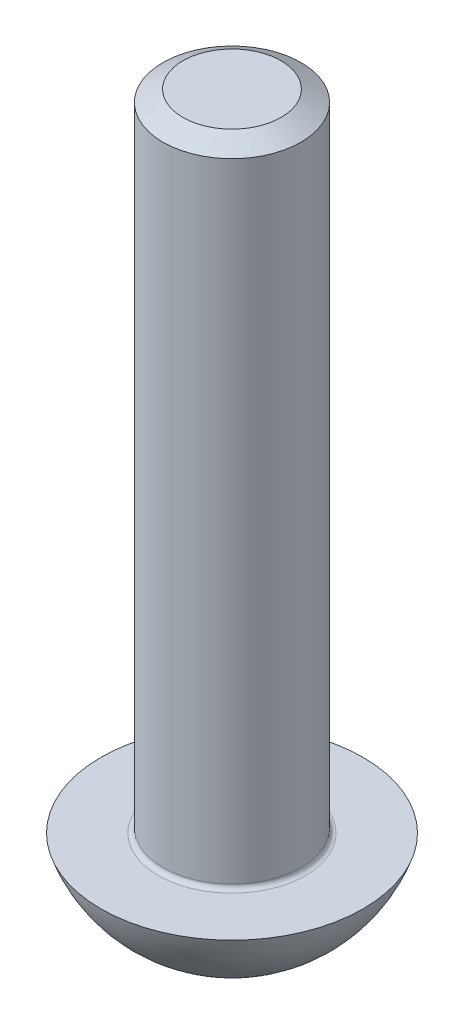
ISO-10303-21;
HEADER;
FILE_DESCRIPTION(('STEP AP214'),'2;1');
FILE_NAME('part.step','',(''),(''),'','','');
FILE_SCHEMA(('AUTOMOTIVE_DESIGN { 1 0 10303 214 1 1 1 1 }'));
ENDSEC;
DATA;
#1=APPLICATION_CONTEXT('core data for automotive mechanical design processes');
#2=APPLICATION_PROTOCOL_DEFINITION('international standard','automotive_design',2000,#1);
#3=PRODUCT_CONTEXT('',#1,'mechanical');
#4=PRODUCT('Part','Part','',(#3));
#5=PRODUCT_RELATED_PRODUCT_CATEGORY('part','',(#4));
#6=PRODUCT_DEFINITION_FORMATION('','',#4);
#7=PRODUCT_DEFINITION_CONTEXT('part definition',#1,'design');
#8=PRODUCT_DEFINITION('design','',#6,#7);
#9=PRODUCT_DEFINITION_SHAPE('','',#8);
#10=(LENGTH_UNIT() NAMED_UNIT(*) SI_UNIT(.MILLI.,.METRE.));
#11=(NAMED_UNIT(*) PLANE_ANGLE_UNIT() SI_UNIT($,.RADIAN.));
#12=(NAMED_UNIT(*) SI_UNIT($,.STERADIAN.) SOLID_ANGLE_UNIT());
#13=UNCERTAINTY_MEASURE_WITH_UNIT(LENGTH_MEASURE(1.E-05),#10,'distance_accuracy_value','');
#14=(GEOMETRIC_REPRESENTATION_CONTEXT(3) GLOBAL_UNCERTAINTY_ASSIGNED_CONTEXT((#13)) GLOBAL_UNIT_ASSIGNED_CONTEXT((#10,
#11,#12)) REPRESENTATION_CONTEXT('',''));
#15=CARTESIAN_POINT('',(0.,0.,0.));
#16=DIRECTION('',(0.,0.,1.));
#17=DIRECTION('',(1.,0.,0.));
#18=AXIS2_PLACEMENT_3D('',#15,#16,#17);
#19=CARTESIAN_POINT('',(1003.04356921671,1012.71699558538,1046.17212852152));
#20=DIRECTION('',(0.,-1.,0.));
#21=DIRECTION('',(0.,0.,1.));
#22=AXIS2_PLACEMENT_3D('',#19,#20,#21);
#23=CYLINDRICAL_SURFACE('',#22,1.50000000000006);
#24=CARTESIAN_POINT('',(1003.04356921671,1014.46699558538,1046.17212852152));
#25=DIRECTION('',(0.,-1.,0.));
#26=DIRECTION('',(0.,0.,1.));
#27=AXIS2_PLACEMENT_3D('',#24,#25,#26);
#28=CIRCLE('',#27,1.50000000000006);
#29=CARTESIAN_POINT('',(1003.04356921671,1014.46699558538,1047.67212852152));
#30=VERTEX_POINT('',#29);
#31=EDGE_CURVE('E162',#30,#30,#28,.T.);
#32=ORIENTED_EDGE('',*,*,#31,.F.);
#33=EDGE_LOOP('',(#32));
#34=FACE_BOUND('',#33,.T.);
#35=CARTESIAN_POINT('',(1003.04356921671,1028.11699558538,1046.17212852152));
#36=DIRECTION('',(0.,-1.,0.));
#37=DIRECTION('',(0.,0.,1.));
#38=AXIS2_PLACEMENT_3D('',#35,#36,#37);
#39=CIRCLE('',#38,1.50000000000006);
#40=CARTESIAN_POINT('',(1003.04356921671,1028.11699558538,1047.67212852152));
#41=VERTEX_POINT('',#40);
#42=EDGE_CURVE('E139',#41,#41,#39,.T.);
#43=ORIENTED_EDGE('',*,*,#42,.T.);
#44=EDGE_LOOP('',(#43));
#45=FACE_BOUND('',#44,.T.);
#46=ADVANCED_FACE('F17',(#34,#45),#23,.T.);
#47=CARTESIAN_POINT('',(1003.04356921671,1012.71699558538,1046.17212852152));
#48=DIRECTION('',(0.,1.,0.));
#49=DIRECTION('',(1.,0.,0.));
#50=AXIS2_PLACEMENT_3D('',#47,#48,#49);
#51=PLANE('',#50);
#52=CARTESIAN_POINT('',(1003.04356921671,1012.71699558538,1046.17212852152));
#53=DIRECTION('',(0.,-1.,0.));
#54=DIRECTION('',(0.,0.,-1.));
#55=AXIS2_PLACEMENT_3D('',#52,#53,#54);
#56=CIRCLE('',#55,1.15470053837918);
#57=CARTESIAN_POINT('',(1003.6209194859,1012.716995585,1045.17212852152));
#58=VERTEX_POINT('',#57);
#59=CARTESIAN_POINT('',(1004.19826975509,1012.716995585,1046.17212852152));
#60=VERTEX_POINT('',#59);
#61=EDGE_CURVE('E186',#58,#60,#56,.T.);
#62=ORIENTED_EDGE('',*,*,#61,.F.);
#63=CARTESIAN_POINT('',(1003.04356921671,1012.71699558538,1046.17212852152));
#64=DIRECTION('',(0.,-1.,0.));
#65=DIRECTION('',(0.,0.,-1.));
#66=AXIS2_PLACEMENT_3D('',#63,#64,#65);
#67=CIRCLE('',#66,1.15470053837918);
#68=CARTESIAN_POINT('',(1002.46621894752,1012.716995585,1045.17212852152));
#69=VERTEX_POINT('',#68);
#70=EDGE_CURVE('E163',#69,#58,#67,.T.);
#71=ORIENTED_EDGE('',*,*,#70,.F.);
#72=CARTESIAN_POINT('',(1003.04356921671,1012.71699558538,1046.17212852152));
#73=DIRECTION('',(0.,-1.,0.));
#74=DIRECTION('',(0.,0.,-1.));
#75=AXIS2_PLACEMENT_3D('',#72,#73,#74);
#76=CIRCLE('',#75,1.15470053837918);
#77=CARTESIAN_POINT('',(1001.88886867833,1012.716995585,1046.17212852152));
#78=VERTEX_POINT('',#77);
#79=EDGE_CURVE('E92',#78,#69,#76,.T.);
#80=ORIENTED_EDGE('',*,*,#79,.F.);
#81=CARTESIAN_POINT('',(1003.04356921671,1012.71699558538,1046.17212852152));
#82=DIRECTION('',(0.,-1.,0.));
#83=DIRECTION('',(0.,0.,1.));
#84=AXIS2_PLACEMENT_3D('',#81,#82,#83);
#85=CIRCLE('',#84,1.15470053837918);
#86=CARTESIAN_POINT('',(1002.46621894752,1012.716995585,1047.17212852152));
#87=VERTEX_POINT('',#86);
#88=EDGE_CURVE('E105',#87,#78,#85,.T.);
#89=ORIENTED_EDGE('',*,*,#88,.F.);
#90=CARTESIAN_POINT('',(1003.04356921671,1012.71699558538,1046.17212852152));
#91=DIRECTION('',(0.,-1.,0.));
#92=DIRECTION('',(0.,0.,-1.));
#93=AXIS2_PLACEMENT_3D('',#90,#91,#92);
#94=CIRCLE('',#93,1.15470053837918);
#95=CARTESIAN_POINT('',(1003.6209194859,1012.71699558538,1047.17212852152));
#96=VERTEX_POINT('',#95);
#97=EDGE_CURVE('E99',#96,#87,#94,.T.);
#98=ORIENTED_EDGE('',*,*,#97,.F.);
#99=CARTESIAN_POINT('',(1003.04356921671,1012.71699558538,1046.17212852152));
#100=DIRECTION('',(0.,-1.,0.));
#101=DIRECTION('',(0.,0.,-1.));
#102=AXIS2_PLACEMENT_3D('',#99,#100,#101);
#103=CIRCLE('',#102,1.15470053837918);
#104=EDGE_CURVE('E106',#60,#96,#103,.T.);
#105=ORIENTED_EDGE('',*,*,#104,.F.);
#106=EDGE_LOOP('',(#62,#71,#80,#89,#98,#105));
#107=FACE_BOUND('',#106,.T.);
#108=CARTESIAN_POINT('',(1003.04356921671,1012.71699558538,1046.17212852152));
#109=DIRECTION('',(0.,-1.,0.));
#110=DIRECTION('',(0.,0.,1.));
#111=AXIS2_PLACEMENT_3D('',#108,#109,#110);
#112=CIRCLE('',#111,1.50000000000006);
#113=CARTESIAN_POINT('',(1001.54356921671,1012.71699558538,1046.17212852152));
#114=VERTEX_POINT('',#113);
#115=EDGE_CURVE('E11',#114,#114,#112,.T.);
#116=ORIENTED_EDGE('',*,*,#115,.T.);
#117=EDGE_LOOP('',(#116));
#118=FACE_BOUND('',#117,.T.);
#119=ADVANCED_FACE('F109',(#107,#118),#51,.F.);
#120=CARTESIAN_POINT('',(1003.04356921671,1015.32154103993,1046.17212852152));
#121=DIRECTION('',(0.,1.,0.));
#122=DIRECTION('',(-1.,0.,0.));
#123=AXIS2_PLACEMENT_3D('',#120,#121,#122);
#124=SPHERICAL_SURFACE('',#123,3.0056042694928);
#125=CARTESIAN_POINT('',(1003.04356921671,1014.36699558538,1046.17212852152));
#126=DIRECTION('',(0.,-1.,0.));
#127=DIRECTION('',(0.,0.,1.));
#128=AXIS2_PLACEMENT_3D('',#125,#126,#127);
#129=CIRCLE('',#128,2.85);
#130=CARTESIAN_POINT('',(1000.19356921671,1014.36699558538,1046.17212852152));
#131=VERTEX_POINT('',#130);
#132=EDGE_CURVE('E33',#131,#131,#129,.T.);
#133=CARTESIAN_POINT('',(1001.54356921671,1012.71699558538,1046.17212852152));
#134=CARTESIAN_POINT('',(1001.52389704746,1012.72832505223,1046.17212852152));
#135=CARTESIAN_POINT('',(1001.50435328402,1012.73987747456,1046.17212852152));
#136=CARTESIAN_POINT('',(1001.46553249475,1012.76342212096,1046.17212852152));
#137=CARTESIAN_POINT('',(1001.44625546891,1012.77541434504,1046.17212852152));
#138=CARTESIAN_POINT('',(1001.40797808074,1012.79983248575,1046.17212852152));
#139=CARTESIAN_POINT('',(1001.38897771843,1012.81225840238,1046.17212852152));
#140=CARTESIAN_POINT('',(1001.35126340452,1012.83753753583,1046.17212852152));
#141=CARTESIAN_POINT('',(1001.33254945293,1012.85039075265,1046.17212852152));
#142=CARTESIAN_POINT('',(1001.29541757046,1012.87651789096,1046.17212852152));
#143=CARTESIAN_POINT('',(1001.27699963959,1012.88979181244,1046.17212852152));
#144=CARTESIAN_POINT('',(1001.24046925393,1012.91675354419,1046.17212852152));
#145=CARTESIAN_POINT('',(1001.22235679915,1012.93044135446,1046.17212852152));
#146=CARTESIAN_POINT('',(1001.18644666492,1012.9582238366,1046.17212852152));
#147=CARTESIAN_POINT('',(1001.16864898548,1012.97231850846,1046.17212852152));
#148=CARTESIAN_POINT('',(1001.13337753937,1013.00090747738,1046.17212852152));
#149=CARTESIAN_POINT('',(1001.11590377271,1013.01540177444,1046.17212852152));
#150=CARTESIAN_POINT('',(1001.08128912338,1013.04478255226,1046.17212852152));
#151=CARTESIAN_POINT('',(1001.06414824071,1013.05966903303,1046.17212852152));
#152=CARTESIAN_POINT('',(1001.03020815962,1013.08982653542,1046.17212852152));
#153=CARTESIAN_POINT('',(1001.01340896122,1013.10509755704,1046.17212852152));
#154=CARTESIAN_POINT('',(1000.98016087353,1013.13601630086,1046.17212852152));
#155=CARTESIAN_POINT('',(1000.96371198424,1013.15166402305,1046.17212852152));
#156=CARTESIAN_POINT('',(1000.93117295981,1013.18332813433,1046.17212852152));
#157=CARTESIAN_POINT('',(1000.91508282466,1013.19934452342,1046.17212852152));
#158=CARTESIAN_POINT('',(1000.88326956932,1013.23173774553,1046.17212852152));
#159=CARTESIAN_POINT('',(1000.86754644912,1013.24811457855,1046.17212852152));
#160=CARTESIAN_POINT('',(1000.83647529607,1013.28122028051,1046.17212852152));
#161=CARTESIAN_POINT('',(1000.82112726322,1013.29794914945,1046.17212852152));
#162=CARTESIAN_POINT('',(1000.79081416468,1013.33175033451,1046.17212852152));
#163=CARTESIAN_POINT('',(1000.77584909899,1013.34882265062,1046.17212852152));
#164=CARTESIAN_POINT('',(1000.74630961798,1013.38330196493,1046.17212852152));
#165=CARTESIAN_POINT('',(1000.73173520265,1013.40070896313,1046.17212852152));
#166=CARTESIAN_POINT('',(1000.70298450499,1013.43584870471,1046.17212852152));
#167=CARTESIAN_POINT('',(1000.68880822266,1013.4535814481,1046.17212852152));
#168=CARTESIAN_POINT('',(1000.66086106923,1013.48936357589,1046.17212852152));
#169=CARTESIAN_POINT('',(1000.64709019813,1013.5074129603,1046.17212852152));
#170=CARTESIAN_POINT('',(1000.61996093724,1013.54381910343,1046.17212852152));
#171=CARTESIAN_POINT('',(1000.60660254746,1013.56217586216,1046.17212852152));
#172=CARTESIAN_POINT('',(1000.58030510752,1013.59918732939,1046.17212852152));
#173=CARTESIAN_POINT('',(1000.56736605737,1013.61784203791,1046.17212852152));
#174=CARTESIAN_POINT('',(1000.54191393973,1013.65543982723,1046.17212852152));
#175=CARTESIAN_POINT('',(1000.52940087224,1013.67438290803,1046.17212852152));
#176=CARTESIAN_POINT('',(1000.50480714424,1013.71254771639,1046.17212852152));
#177=CARTESIAN_POINT('',(1000.49272648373,1013.73176944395,1046.17212852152));
#178=CARTESIAN_POINT('',(1000.469003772,1013.77048167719,1046.17212852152));
#179=CARTESIAN_POINT('',(1000.45736172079,1013.78997218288,1046.17212852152));
#180=CARTESIAN_POINT('',(1000.4345222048,1013.8292119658,1046.17212852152));
#181=CARTESIAN_POINT('',(1000.42332474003,1013.84896124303,1046.17212852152));
#182=CARTESIAN_POINT('',(1000.40138014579,1013.88870842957,1046.17212852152));
#183=CARTESIAN_POINT('',(1000.39063301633,1013.90870633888,1046.17212852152));
#184=CARTESIAN_POINT('',(1000.36959461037,1013.94894052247,1046.17212852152));
#185=CARTESIAN_POINT('',(1000.35930333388,1013.96917679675,1046.17212852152));
#186=CARTESIAN_POINT('',(1000.33918191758,1014.00987732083,1046.17212852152));
#187=CARTESIAN_POINT('',(1000.32935177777,1014.03034157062,1046.17212852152));
#188=CARTESIAN_POINT('',(1000.31015768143,1014.07148753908,1046.17212852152));
#189=CARTESIAN_POINT('',(1000.3007937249,1014.09216925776,1046.17212852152));
#190=CARTESIAN_POINT('',(1000.28253680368,1014.13373954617,1046.17212852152));
#191=CARTESIAN_POINT('',(1000.273643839,1014.15462811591,1046.17212852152));
#192=CARTESIAN_POINT('',(1000.25633346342,1014.19660138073,1046.17212852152));
#193=CARTESIAN_POINT('',(1000.24791605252,1014.2176860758,1046.17212852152));
#194=CARTESIAN_POINT('',(1000.23156112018,1014.26004077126,1046.17212852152));
#195=CARTESIAN_POINT('',(1000.22362359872,1014.28131077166,1046.17212852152));
#196=CARTESIAN_POINT('',(1000.20823246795,1014.32402513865,1046.17212852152));
#197=CARTESIAN_POINT('',(1000.20077885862,1014.34546950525,1046.17212852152));
#198=CARTESIAN_POINT('',(1000.19356921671,1014.36699558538,1046.17212852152));
#199=B_SPLINE_CURVE_WITH_KNOTS('',3,(#133,#134,#135,#136,#137,#138,#139,#140,#141,#142,#143,
#144,#145,#146,#147,#148,#149,#150,#151,#152,#153,#154,#155,#156,#157,#158,#159,#160,#161,#162,
#163,#164,#165,#166,#167,#168,#169,#170,#171,#172,#173,#174,#175,#176,#177,#178,#179,#180,#181,
#182,#183,#184,#185,#186,#187,#188,#189,#190,#191,#192,#193,#194,#195,#196,#197,#198),
.UNSPECIFIED.,.F.,.F.,(4,2,2,2,2,2,2,2,2,2,2,2,2,2,2,2,2,2,2,2,2,2,2,2,2,2,2,2,2,2,2,2,4),(0.,
0.0681025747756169,0.136205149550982,0.204307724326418,0.272410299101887,0.340512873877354,
0.408615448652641,0.476718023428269,0.544820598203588,0.612923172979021,0.681025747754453,
0.749128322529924,0.817230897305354,0.885333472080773,0.953436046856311,1.02153862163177,
1.08964119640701,1.15774377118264,1.22584634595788,1.29394892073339,1.36205149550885,
1.43015407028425,1.49825664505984,1.56635921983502,1.6344617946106,1.70256436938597,
1.77066694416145,1.83876951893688,1.90687209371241,1.97497466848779,2.04307724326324,
2.11117981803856,2.17928239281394),.UNSPECIFIED.);
#200=EDGE_CURVE('BSEAM296',#114,#131,#199,.T.);
#201=ORIENTED_EDGE('',*,*,#115,.F.);
#202=ORIENTED_EDGE('',*,*,#132,.T.);
#203=ORIENTED_EDGE('',*,*,#200,.T.);
#204=ORIENTED_EDGE('',*,*,#200,.F.);
#205=EDGE_LOOP('',(#201,#203,#202,#204));
#206=FACE_BOUND('',#205,.T.);
#207=ADVANCED_FACE('F296',(#206),#124,.T.);
#208=CARTESIAN_POINT('',(1001.44356921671,1014.36699558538,1046.17212852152));
#209=DIRECTION('',(0.,-1.,0.));
#210=DIRECTION('',(0.,0.,-1.));
#211=AXIS2_PLACEMENT_3D('',#208,#209,#210);
#212=PLANE('',#211);
#213=CARTESIAN_POINT('',(1003.04356921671,1014.36699558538,1046.17212852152));
#214=DIRECTION('',(0.,-1.,0.));
#215=DIRECTION('',(0.,0.,1.));
#216=AXIS2_PLACEMENT_3D('',#213,#214,#215);
#217=CIRCLE('',#216,1.60000000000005);
#218=CARTESIAN_POINT('',(1003.04356921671,1014.36699558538,1047.77212852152));
#219=VERTEX_POINT('',#218);
#220=EDGE_CURVE('E158',#219,#219,#217,.T.);
#221=ORIENTED_EDGE('',*,*,#220,.T.);
#222=EDGE_LOOP('',(#221));
#223=FACE_BOUND('',#222,.T.);
#224=ORIENTED_EDGE('',*,*,#132,.F.);
#225=EDGE_LOOP('',(#224));
#226=FACE_BOUND('',#225,.T.);
#227=ADVANCED_FACE('F302',(#223,#226),#212,.F.);
#228=CARTESIAN_POINT('',(1003.04356921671,1014.46699558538,1046.17212852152));
#229=DIRECTION('',(0.,-1.,0.));
#230=DIRECTION('',(0.,0.,1.));
#231=AXIS2_PLACEMENT_3D('',#228,#229,#230);
#232=TOROIDAL_SURFACE('',#231,1.6,0.1);
#233=ORIENTED_EDGE('',*,*,#31,.T.);
#234=EDGE_LOOP('',(#233));
#235=FACE_BOUND('',#234,.T.);
#236=ORIENTED_EDGE('',*,*,#220,.F.);
#237=EDGE_LOOP('',(#236));
#238=FACE_BOUND('',#237,.T.);
#239=ADVANCED_FACE('F299',(#235,#238),#232,.F.);
#240=CARTESIAN_POINT('',(1003.04356921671,13.01699558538,1046.17212852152));
#241=DIRECTION('',(0.,-1.,0.));
#242=DIRECTION('',(0.,0.,1.));
#243=AXIS2_PLACEMENT_3D('',#240,#241,#242);
#244=CONICAL_SURFACE('',#243,3849.00179459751,1.31660847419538);
#245=CARTESIAN_POINT('',(1003.6209194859,1012.71699558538,1045.17212852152));
#246=CARTESIAN_POINT('',(1003.57295814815,1012.7232283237,1045.17212852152));
#247=CARTESIAN_POINT('',(1003.5249149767,1012.72888578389,1045.17212852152));
#248=CARTESIAN_POINT('',(1003.42866910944,1012.73882440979,1045.17212852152));
#249=CARTESIAN_POINT('',(1003.38046635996,1012.74310505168,1045.17212852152));
#250=CARTESIAN_POINT('',(1003.28417623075,1012.75004234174,1045.17212852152));
#251=CARTESIAN_POINT('',(1003.23608942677,1012.75270677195,1045.17212852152));
#252=CARTESIAN_POINT('',(1003.13985814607,1012.75627942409,1045.17212852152));
#253=CARTESIAN_POINT('',(1003.09171368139,1012.75718796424,1045.17212852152));
#254=CARTESIAN_POINT('',(1002.99542475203,1012.75718796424,1045.17212852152));
#255=CARTESIAN_POINT('',(1002.94728028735,1012.75627942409,1045.17212852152));
#256=CARTESIAN_POINT('',(1002.85104900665,1012.75270677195,1045.17212852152));
#257=CARTESIAN_POINT('',(1002.80296220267,1012.75004234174,1045.17212852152));
#258=CARTESIAN_POINT('',(1002.70667207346,1012.74310505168,1045.17212852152));
#259=CARTESIAN_POINT('',(1002.65846932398,1012.73882440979,1045.17212852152));
#260=CARTESIAN_POINT('',(1002.56222345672,1012.72888578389,1045.17212852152));
#261=CARTESIAN_POINT('',(1002.51418028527,1012.7232283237,1045.17212852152));
#262=CARTESIAN_POINT('',(1002.46621894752,1012.71699558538,1045.17212852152));
#263=B_SPLINE_CURVE_WITH_KNOTS('',3,(#245,#246,#247,#248,#249,#250,#251,#252,#253,#254,#255,
#256,#257,#258,#259,#260,#261,#262),.UNSPECIFIED.,.F.,.F.,(4,2,2,2,2,2,2,2,4),(0.,
0.145100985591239,0.290257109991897,0.434708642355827,0.579133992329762,0.723559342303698,
0.868010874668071,1.01316699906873,1.15826798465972),.UNSPECIFIED.);
#264=EDGE_CURVE('E184',#58,#69,#263,.T.);
#265=ORIENTED_EDGE('',*,*,#264,.T.);
#266=ORIENTED_EDGE('',*,*,#70,.T.);
#267=EDGE_LOOP('',(#265,#266));
#268=FACE_BOUND('',#267,.T.);
#269=ADVANCED_FACE('F227',(#268),#244,.F.);
#270=CARTESIAN_POINT('',(1003.04356921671,13.01699558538,1046.17212852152));
#271=DIRECTION('',(0.,-1.,0.));
#272=DIRECTION('',(0.,0.,1.));
#273=AXIS2_PLACEMENT_3D('',#270,#271,#272);
#274=CONICAL_SURFACE('',#273,3849.00179459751,1.31660847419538);
#275=CARTESIAN_POINT('',(1002.46621894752,1012.71699558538,1045.17212852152));
#276=CARTESIAN_POINT('',(1002.44223827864,1012.7232283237,1045.21366425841));
#277=CARTESIAN_POINT('',(1002.41821669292,1012.72888578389,1045.25527086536));
#278=CARTESIAN_POINT('',(1002.37009375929,1012.73882440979,1045.33862223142));
#279=CARTESIAN_POINT('',(1002.34599238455,1012.74310505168,1045.380367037));
#280=CARTESIAN_POINT('',(1002.29784731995,1012.75004234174,1045.46375673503));
#281=CARTESIAN_POINT('',(1002.27380391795,1012.75270677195,1045.50540112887));
#282=CARTESIAN_POINT('',(1002.2256882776,1012.75627942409,1045.58873986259));
#283=CARTESIAN_POINT('',(1002.20161604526,1012.75718796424,1045.63043419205));
#284=CARTESIAN_POINT('',(1002.15347158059,1012.75718796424,1045.71382285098));
#285=CARTESIAN_POINT('',(1002.12939934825,1012.75627942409,1045.75551718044));
#286=CARTESIAN_POINT('',(1002.0812837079,1012.75270677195,1045.83885591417));
#287=CARTESIAN_POINT('',(1002.0572403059,1012.75004234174,1045.88050030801));
#288=CARTESIAN_POINT('',(1002.0090952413,1012.74310505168,1045.96389000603));
#289=CARTESIAN_POINT('',(1001.98499386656,1012.73882440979,1046.00563481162));
#290=CARTESIAN_POINT('',(1001.93687093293,1012.72888578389,1046.08898617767));
#291=CARTESIAN_POINT('',(1001.91284934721,1012.7232283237,1046.13059278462));
#292=CARTESIAN_POINT('',(1001.88886867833,1012.71699558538,1046.17212852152));
#293=B_SPLINE_CURVE_WITH_KNOTS('',3,(#275,#276,#277,#278,#279,#280,#281,#282,#283,#284,#285,
#286,#287,#288,#289,#290,#291,#292),.UNSPECIFIED.,.F.,.F.,(4,2,2,2,2,2,2,2,4),(0.,
0.145100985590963,0.290257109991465,0.434708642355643,0.579133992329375,0.723559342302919,
0.868010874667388,1.01316699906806,1.15826798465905),.UNSPECIFIED.);
#294=EDGE_CURVE('E174',#69,#78,#293,.T.);
#295=ORIENTED_EDGE('',*,*,#294,.T.);
#296=ORIENTED_EDGE('',*,*,#79,.T.);
#297=EDGE_LOOP('',(#295,#296));
#298=FACE_BOUND('',#297,.T.);
#299=ADVANCED_FACE('F330',(#298),#274,.F.);
#300=CARTESIAN_POINT('',(1003.04356921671,13.01699558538,1046.17212852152));
#301=DIRECTION('',(0.,-1.,0.));
#302=DIRECTION('',(0.,0.,1.));
#303=AXIS2_PLACEMENT_3D('',#300,#301,#302);
#304=CONICAL_SURFACE('',#303,3849.00179459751,1.31660847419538);
#305=CARTESIAN_POINT('',(1001.88886867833,1012.71699558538,1046.17212852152));
#306=CARTESIAN_POINT('',(1001.91284934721,1012.7232283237,1046.21366425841));
#307=CARTESIAN_POINT('',(1001.93687093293,1012.72888578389,1046.25527086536));
#308=CARTESIAN_POINT('',(1001.98499386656,1012.73882440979,1046.33862223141));
#309=CARTESIAN_POINT('',(1002.0090952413,1012.74310505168,1046.380367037));
#310=CARTESIAN_POINT('',(1002.0572403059,1012.75004234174,1046.46375673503));
#311=CARTESIAN_POINT('',(1002.0812837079,1012.75270677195,1046.50540112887));
#312=CARTESIAN_POINT('',(1002.12939934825,1012.75627942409,1046.58873986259));
#313=CARTESIAN_POINT('',(1002.15347158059,1012.75718796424,1046.63043419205));
#314=CARTESIAN_POINT('',(1002.20161604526,1012.75718796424,1046.71382285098));
#315=CARTESIAN_POINT('',(1002.2256882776,1012.75627942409,1046.75551718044));
#316=CARTESIAN_POINT('',(1002.27380391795,1012.75270677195,1046.83885591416));
#317=CARTESIAN_POINT('',(1002.29784731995,1012.75004234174,1046.88050030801));
#318=CARTESIAN_POINT('',(1002.34599238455,1012.74310505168,1046.96389000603));
#319=CARTESIAN_POINT('',(1002.37009375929,1012.73882440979,1047.00563481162));
#320=CARTESIAN_POINT('',(1002.41821669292,1012.72888578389,1047.08898617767));
#321=CARTESIAN_POINT('',(1002.44223827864,1012.7232283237,1047.13059278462));
#322=CARTESIAN_POINT('',(1002.46621894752,1012.71699558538,1047.17212852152));
#323=B_SPLINE_CURVE_WITH_KNOTS('',3,(#305,#306,#307,#308,#309,#310,#311,#312,#313,#314,#315,
#316,#317,#318,#319,#320,#321,#322),.UNSPECIFIED.,.F.,.F.,(4,2,2,2,2,2,2,2,4),(0.,
0.145100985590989,0.290257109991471,0.434708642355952,0.579133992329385,0.72355934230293,
0.868010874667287,1.01316699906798,1.15826798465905),.UNSPECIFIED.);
#324=EDGE_CURVE('E20',#78,#87,#323,.T.);
#325=ORIENTED_EDGE('',*,*,#324,.T.);
#326=ORIENTED_EDGE('',*,*,#88,.T.);
#327=EDGE_LOOP('',(#325,#326));
#328=FACE_BOUND('',#327,.T.);
#329=ADVANCED_FACE('F136',(#328),#304,.F.);
#330=CARTESIAN_POINT('',(1003.04356921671,13.01699558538,1046.17212852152));
#331=DIRECTION('',(0.,-1.,0.));
#332=DIRECTION('',(0.,0.,1.));
#333=AXIS2_PLACEMENT_3D('',#330,#331,#332);
#334=CONICAL_SURFACE('',#333,3849.00179459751,1.31660847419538);
#335=ORIENTED_EDGE('',*,*,#97,.T.);
#336=CARTESIAN_POINT('',(1002.46621894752,1012.71699558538,1047.17212852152));
#337=CARTESIAN_POINT('',(1002.51418028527,1012.7232283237,1047.17212852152));
#338=CARTESIAN_POINT('',(1002.56222345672,1012.72888578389,1047.17212852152));
#339=CARTESIAN_POINT('',(1002.65846932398,1012.73882440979,1047.17212852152));
#340=CARTESIAN_POINT('',(1002.70667207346,1012.74310505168,1047.17212852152));
#341=CARTESIAN_POINT('',(1002.80296220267,1012.75004234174,1047.17212852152));
#342=CARTESIAN_POINT('',(1002.85104900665,1012.75270677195,1047.17212852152));
#343=CARTESIAN_POINT('',(1002.94728028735,1012.75627942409,1047.17212852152));
#344=CARTESIAN_POINT('',(1002.99542475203,1012.75718796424,1047.17212852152));
#345=CARTESIAN_POINT('',(1003.09171368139,1012.75718796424,1047.17212852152));
#346=CARTESIAN_POINT('',(1003.13985814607,1012.75627942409,1047.17212852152));
#347=CARTESIAN_POINT('',(1003.23608942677,1012.75270677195,1047.17212852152));
#348=CARTESIAN_POINT('',(1003.28417623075,1012.75004234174,1047.17212852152));
#349=CARTESIAN_POINT('',(1003.38046635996,1012.74310505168,1047.17212852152));
#350=CARTESIAN_POINT('',(1003.42866910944,1012.73882440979,1047.17212852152));
#351=CARTESIAN_POINT('',(1003.5249149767,1012.72888578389,1047.17212852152));
#352=CARTESIAN_POINT('',(1003.57295814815,1012.7232283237,1047.17212852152));
#353=CARTESIAN_POINT('',(1003.6209194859,1012.71699558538,1047.17212852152));
#354=B_SPLINE_CURVE_WITH_KNOTS('',3,(#336,#337,#338,#339,#340,#341,#342,#343,#344,#345,#346,
#347,#348,#349,#350,#351,#352,#353),.UNSPECIFIED.,.F.,.F.,(4,2,2,2,2,2,2,2,4),(0.,
0.145100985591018,0.290257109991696,0.434708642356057,0.579133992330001,0.723559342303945,
0.868010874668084,1.01316699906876,1.15826798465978),.UNSPECIFIED.);
#355=EDGE_CURVE('E102',#87,#96,#354,.T.);
#356=ORIENTED_EDGE('',*,*,#355,.T.);
#357=EDGE_LOOP('',(#335,#356));
#358=FACE_BOUND('',#357,.T.);
#359=ADVANCED_FACE('F100',(#358),#334,.F.);
#360=CARTESIAN_POINT('',(1003.04356921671,13.01699558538,1046.17212852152));
#361=DIRECTION('',(0.,-1.,0.));
#362=DIRECTION('',(0.,0.,1.));
#363=AXIS2_PLACEMENT_3D('',#360,#361,#362);
#364=CONICAL_SURFACE('',#363,3849.00179459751,1.31660847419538);
#365=CARTESIAN_POINT('',(1003.6209194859,1012.71699558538,1047.17212852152));
#366=CARTESIAN_POINT('',(1003.64490015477,1012.7232283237,1047.13059278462));
#367=CARTESIAN_POINT('',(1003.6689217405,1012.72888578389,1047.08898617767));
#368=CARTESIAN_POINT('',(1003.71704467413,1012.73882440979,1047.00563481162));
#369=CARTESIAN_POINT('',(1003.74114604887,1012.74310505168,1046.96389000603));
#370=CARTESIAN_POINT('',(1003.78929111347,1012.75004234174,1046.88050030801));
#371=CARTESIAN_POINT('',(1003.81333451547,1012.75270677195,1046.83885591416));
#372=CARTESIAN_POINT('',(1003.86145015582,1012.75627942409,1046.75551718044));
#373=CARTESIAN_POINT('',(1003.88552238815,1012.75718796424,1046.71382285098));
#374=CARTESIAN_POINT('',(1003.93366685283,1012.75718796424,1046.63043419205));
#375=CARTESIAN_POINT('',(1003.95773908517,1012.75627942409,1046.58873986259));
#376=CARTESIAN_POINT('',(1004.00585472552,1012.75270677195,1046.50540112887));
#377=CARTESIAN_POINT('',(1004.02989812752,1012.75004234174,1046.46375673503));
#378=CARTESIAN_POINT('',(1004.07804319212,1012.74310505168,1046.380367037));
#379=CARTESIAN_POINT('',(1004.10214456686,1012.73882440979,1046.33862223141));
#380=CARTESIAN_POINT('',(1004.15026750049,1012.72888578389,1046.25527086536));
#381=CARTESIAN_POINT('',(1004.17428908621,1012.72322832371,1046.21366425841));
#382=CARTESIAN_POINT('',(1004.19826975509,1012.71699558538,1046.17212852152));
#383=B_SPLINE_CURVE_WITH_KNOTS('',3,(#365,#366,#367,#368,#369,#370,#371,#372,#373,#374,#375,
#376,#377,#378,#379,#380,#381,#382),.UNSPECIFIED.,.F.,.F.,(4,2,2,2,2,2,2,2,4),(0.,
0.145100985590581,0.290257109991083,0.434708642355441,0.579133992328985,0.723559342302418,
0.868010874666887,1.01316699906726,1.15826798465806),.UNSPECIFIED.);
#384=EDGE_CURVE('E200',#96,#60,#383,.T.);
#385=ORIENTED_EDGE('',*,*,#384,.T.);
#386=ORIENTED_EDGE('',*,*,#104,.T.);
#387=EDGE_LOOP('',(#385,#386));
#388=FACE_BOUND('',#387,.T.);
#389=ADVANCED_FACE('F229',(#388),#364,.F.);
#390=CARTESIAN_POINT('',(1003.04356921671,13.01699558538,1046.17212852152));
#391=DIRECTION('',(0.,-1.,0.));
#392=DIRECTION('',(0.,0.,1.));
#393=AXIS2_PLACEMENT_3D('',#390,#391,#392);
#394=CONICAL_SURFACE('',#393,3849.00179459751,1.31660847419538);
#395=CARTESIAN_POINT('',(1004.19826975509,1012.71699558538,1046.17212852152));
#396=CARTESIAN_POINT('',(1004.17428908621,1012.7232283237,1046.13059278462));
#397=CARTESIAN_POINT('',(1004.15026750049,1012.72888578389,1046.08898617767));
#398=CARTESIAN_POINT('',(1004.10214456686,1012.73882440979,1046.00563481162));
#399=CARTESIAN_POINT('',(1004.07804319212,1012.74310505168,1045.96389000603));
#400=CARTESIAN_POINT('',(1004.02989812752,1012.75004234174,1045.88050030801));
#401=CARTESIAN_POINT('',(1004.00585472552,1012.75270677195,1045.83885591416));
#402=CARTESIAN_POINT('',(1003.95773908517,1012.75627942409,1045.75551718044));
#403=CARTESIAN_POINT('',(1003.93366685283,1012.75718796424,1045.71382285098));
#404=CARTESIAN_POINT('',(1003.88552238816,1012.75718796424,1045.63043419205));
#405=CARTESIAN_POINT('',(1003.86145015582,1012.75627942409,1045.58873986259));
#406=CARTESIAN_POINT('',(1003.81333451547,1012.75270677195,1045.50540112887));
#407=CARTESIAN_POINT('',(1003.78929111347,1012.75004234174,1045.46375673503));
#408=CARTESIAN_POINT('',(1003.74114604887,1012.74310505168,1045.380367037));
#409=CARTESIAN_POINT('',(1003.71704467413,1012.73882440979,1045.33862223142));
#410=CARTESIAN_POINT('',(1003.6689217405,1012.72888578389,1045.25527086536));
#411=CARTESIAN_POINT('',(1003.64490015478,1012.7232283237,1045.21366425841));
#412=CARTESIAN_POINT('',(1003.6209194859,1012.71699558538,1045.17212852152));
#413=B_SPLINE_CURVE_WITH_KNOTS('',3,(#395,#396,#397,#398,#399,#400,#401,#402,#403,#404,#405,
#406,#407,#408,#409,#410,#411,#412),.UNSPECIFIED.,.F.,.F.,(4,2,2,2,2,2,2,2,4),(0.,
0.145100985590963,0.290257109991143,0.434708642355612,0.579133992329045,0.723559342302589,
0.868010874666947,1.01316699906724,1.1582679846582),.UNSPECIFIED.);
#414=EDGE_CURVE('E195',#60,#58,#413,.T.);
#415=ORIENTED_EDGE('',*,*,#414,.T.);
#416=ORIENTED_EDGE('',*,*,#61,.T.);
#417=EDGE_LOOP('',(#415,#416));
#418=FACE_BOUND('',#417,.T.);
#419=ADVANCED_FACE('F225',(#418),#394,.F.);
#420=CARTESIAN_POINT('',(1003.04356921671,1013.75699558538,1046.17212852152));
#421=DIRECTION('',(0.,-1.,0.));
#422=DIRECTION('',(0.,0.,1.));
#423=AXIS2_PLACEMENT_3D('',#420,#421,#422);
#424=CONICAL_SURFACE('',#423,1.15470053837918,1.08478502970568);
#425=CARTESIAN_POINT('',(1001.88886867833,1013.75699558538,1046.17212852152));
#426=CARTESIAN_POINT('',(1001.91405325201,1013.77030439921,1046.12850756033));
#427=CARTESIAN_POINT('',(1001.93941977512,1013.78239781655,1046.0845714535));
#428=CARTESIAN_POINT('',(1001.99051798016,1013.80351934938,1045.9960667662));
#429=CARTESIAN_POINT('',(1002.01625027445,1013.81254147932,1045.95149712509));
#430=CARTESIAN_POINT('',(1002.06744849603,1013.82668154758,1045.86281920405));
#431=CARTESIAN_POINT('',(1002.09290893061,1013.83187635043,1045.81872043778));
#432=CARTESIAN_POINT('',(1002.14393437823,1013.83820326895,1045.73034177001));
#433=CARTESIAN_POINT('',(1002.16949926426,1013.83933936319,1045.68606208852));
#434=CARTESIAN_POINT('',(1002.21773095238,1013.83755933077,1045.60252235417));
#435=CARTESIAN_POINT('',(1002.24040217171,1013.83508210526,1045.56325465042));
#436=CARTESIAN_POINT('',(1002.28562209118,1013.82703335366,1045.48493145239));
#437=CARTESIAN_POINT('',(1002.30817068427,1013.82145946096,1045.44587614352));
#438=CARTESIAN_POINT('',(1002.35347316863,1013.80744981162,1045.36740993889));
#439=CARTESIAN_POINT('',(1002.37622294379,1013.79896219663,1045.32800617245));
#440=CARTESIAN_POINT('',(1002.42143409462,1013.77962986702,1045.24969816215));
#441=CARTESIAN_POINT('',(1002.44389587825,1013.76878899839,1045.21079321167));
#442=CARTESIAN_POINT('',(1002.46621894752,1013.75699558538,1045.17212852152));
#443=B_SPLINE_CURVE_WITH_KNOTS('',3,(#425,#426,#427,#428,#429,#430,#431,#432,#433,#434,#435,
#436,#437,#438,#439,#440,#441,#442),.UNSPECIFIED.,.F.,.F.,(4,2,2,2,2,2,2,2,4),(0.,
0.15634100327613,0.312984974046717,0.466390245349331,0.619645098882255,0.755763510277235,
0.891986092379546,1.03077096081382,1.16933069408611),.UNSPECIFIED.);
#444=CARTESIAN_POINT('',(1001.88886867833,1013.75699558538,1046.17212852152));
#445=VERTEX_POINT('',#444);
#446=CARTESIAN_POINT('',(1002.46621894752,1013.75699558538,1045.17212852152));
#447=VERTEX_POINT('',#446);
#448=EDGE_CURVE('E190',#445,#447,#443,.T.);
#449=ORIENTED_EDGE('',*,*,#448,.T.);
#450=CARTESIAN_POINT('',(1002.46621894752,1013.75699558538,1045.17212852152));
#451=CARTESIAN_POINT('',(1002.51372575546,1013.76954610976,1045.17212852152));
#452=CARTESIAN_POINT('',(1002.5615512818,1013.78101702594,1045.17212852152));
#453=CARTESIAN_POINT('',(1002.65785399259,1013.80126561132,1045.17212852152));
#454=CARTESIAN_POINT('',(1002.70633219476,1013.81003839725,1045.17212852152));
#455=CARTESIAN_POINT('',(1002.80282839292,1013.82416776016,1045.17212852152));
#456=CARTESIAN_POINT('',(1002.85083679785,1013.82958789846,1045.17212852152));
#457=CARTESIAN_POINT('',(1002.94708670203,1013.83686249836,1045.17212852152));
#458=CARTESIAN_POINT('',(1002.99532795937,1013.83872008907,1045.17212852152));
#459=CARTESIAN_POINT('',(1003.09181047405,1013.83872008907,1045.17212852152));
#460=CARTESIAN_POINT('',(1003.14005173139,1013.83686249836,1045.17212852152));
#461=CARTESIAN_POINT('',(1003.23630163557,1013.82958789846,1045.17212852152));
#462=CARTESIAN_POINT('',(1003.2843100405,1013.82416776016,1045.17212852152));
#463=CARTESIAN_POINT('',(1003.38080623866,1013.81003839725,1045.17212852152));
#464=CARTESIAN_POINT('',(1003.42928444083,1013.80126561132,1045.17212852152));
#465=CARTESIAN_POINT('',(1003.52558715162,1013.78101702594,1045.17212852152));
#466=CARTESIAN_POINT('',(1003.57341267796,1013.76954610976,1045.17212852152));
#467=CARTESIAN_POINT('',(1003.6209194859,1013.75699558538,1045.17212852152));
#468=B_SPLINE_CURVE_WITH_KNOTS('',3,(#450,#451,#452,#453,#454,#455,#456,#457,#458,#459,#460,
#461,#462,#463,#464,#465,#466,#467),.UNSPECIFIED.,.F.,.F.,(4,2,2,2,2,2,2,2,4),(0.,
0.147446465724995,0.295158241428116,0.439976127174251,0.584666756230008,0.729357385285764,
0.874175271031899,1.02188704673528,1.16933351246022),.UNSPECIFIED.);
#469=CARTESIAN_POINT('',(1003.6209194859,1013.75699558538,1045.17212852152));
#470=VERTEX_POINT('',#469);
#471=EDGE_CURVE('E175',#447,#470,#468,.T.);
#472=ORIENTED_EDGE('',*,*,#471,.T.);
#473=CARTESIAN_POINT('',(1003.6209194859,1013.75699558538,1045.17212852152));
#474=CARTESIAN_POINT('',(1003.64610405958,1013.77030439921,1045.2157494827));
#475=CARTESIAN_POINT('',(1003.67147058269,1013.78239781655,1045.25968558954));
#476=CARTESIAN_POINT('',(1003.72256878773,1013.80351934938,1045.34819027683));
#477=CARTESIAN_POINT('',(1003.74830108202,1013.81254147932,1045.39275991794));
#478=CARTESIAN_POINT('',(1003.7994993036,1013.82668154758,1045.48143783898));
#479=CARTESIAN_POINT('',(1003.82495973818,1013.83187635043,1045.52553660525));
#480=CARTESIAN_POINT('',(1003.8759851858,1013.83820326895,1045.61391527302));
#481=CARTESIAN_POINT('',(1003.90155007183,1013.83933936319,1045.65819495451));
#482=CARTESIAN_POINT('',(1003.94978175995,1013.83755933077,1045.74173468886));
#483=CARTESIAN_POINT('',(1003.97245297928,1013.83508210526,1045.78100239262));
#484=CARTESIAN_POINT('',(1004.01767289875,1013.82703335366,1045.85932559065));
#485=CARTESIAN_POINT('',(1004.04022149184,1013.82145946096,1045.89838089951));
#486=CARTESIAN_POINT('',(1004.0855239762,1013.80744981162,1045.97684710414));
#487=CARTESIAN_POINT('',(1004.10827375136,1013.79896219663,1046.01625087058));
#488=CARTESIAN_POINT('',(1004.15348490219,1013.77962986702,1046.09455888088));
#489=CARTESIAN_POINT('',(1004.17594668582,1013.76878899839,1046.13346383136));
#490=CARTESIAN_POINT('',(1004.19826975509,1013.75699558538,1046.17212852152));
#491=B_SPLINE_CURVE_WITH_KNOTS('',3,(#473,#474,#475,#476,#477,#478,#479,#480,#481,#482,#483,
#484,#485,#486,#487,#488,#489,#490),.UNSPECIFIED.,.F.,.F.,(4,2,2,2,2,2,2,2,4),(0.,
0.156341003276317,0.312984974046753,0.466390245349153,0.61964509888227,0.755763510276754,
0.891986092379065,1.03077096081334,1.1693306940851),.UNSPECIFIED.);
#492=CARTESIAN_POINT('',(1004.19826975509,1013.75699558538,1046.17212852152));
#493=VERTEX_POINT('',#492);
#494=EDGE_CURVE('E185',#470,#493,#491,.T.);
#495=ORIENTED_EDGE('',*,*,#494,.T.);
#496=CARTESIAN_POINT('',(1004.19826975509,1013.75699558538,1046.17212852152));
#497=CARTESIAN_POINT('',(1004.17308518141,1013.77030439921,1046.2157494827));
#498=CARTESIAN_POINT('',(1004.1477186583,1013.78239781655,1046.25968558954));
#499=CARTESIAN_POINT('',(1004.09662045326,1013.80351934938,1046.34819027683));
#500=CARTESIAN_POINT('',(1004.07088815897,1013.81254147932,1046.39275991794));
#501=CARTESIAN_POINT('',(1004.01968993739,1013.82668154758,1046.48143783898));
#502=CARTESIAN_POINT('',(1003.99422950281,1013.83187635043,1046.52553660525));
#503=CARTESIAN_POINT('',(1003.94320405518,1013.83820326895,1046.61391527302));
#504=CARTESIAN_POINT('',(1003.91763916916,1013.83933936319,1046.65819495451));
#505=CARTESIAN_POINT('',(1003.86940748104,1013.83755933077,1046.74173468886));
#506=CARTESIAN_POINT('',(1003.84673626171,1013.83508210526,1046.78100239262));
#507=CARTESIAN_POINT('',(1003.80151634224,1013.82703335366,1046.85932559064));
#508=CARTESIAN_POINT('',(1003.77896774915,1013.82145946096,1046.89838089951));
#509=CARTESIAN_POINT('',(1003.73366526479,1013.80744981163,1046.97684710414));
#510=CARTESIAN_POINT('',(1003.71091548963,1013.79896219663,1047.01625087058));
#511=CARTESIAN_POINT('',(1003.6657043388,1013.77962986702,1047.09455888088));
#512=CARTESIAN_POINT('',(1003.64324255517,1013.76878899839,1047.13346383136));
#513=CARTESIAN_POINT('',(1003.6209194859,1013.75699558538,1047.17212852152));
#514=B_SPLINE_CURVE_WITH_KNOTS('',3,(#496,#497,#498,#499,#500,#501,#502,#503,#504,#505,#506,
#507,#508,#509,#510,#511,#512,#513),.UNSPECIFIED.,.F.,.F.,(4,2,2,2,2,2,2,2,4),(0.,
0.15634100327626,0.312984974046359,0.466390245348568,0.619645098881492,0.755763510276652,
0.891986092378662,1.03077096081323,1.16933069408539),.UNSPECIFIED.);
#515=CARTESIAN_POINT('',(1003.6209194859,1013.75699558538,1047.17212852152));
#516=VERTEX_POINT('',#515);
#517=EDGE_CURVE('E196',#493,#516,#514,.T.);
#518=ORIENTED_EDGE('',*,*,#517,.T.);
#519=CARTESIAN_POINT('',(1003.6209194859,1013.75699558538,1047.17212852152));
#520=CARTESIAN_POINT('',(1003.57341267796,1013.76954610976,1047.17212852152));
#521=CARTESIAN_POINT('',(1003.52558715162,1013.78101702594,1047.17212852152));
#522=CARTESIAN_POINT('',(1003.42928444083,1013.80126561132,1047.17212852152));
#523=CARTESIAN_POINT('',(1003.38080623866,1013.81003839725,1047.17212852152));
#524=CARTESIAN_POINT('',(1003.2843100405,1013.82416776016,1047.17212852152));
#525=CARTESIAN_POINT('',(1003.23630163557,1013.82958789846,1047.17212852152));
#526=CARTESIAN_POINT('',(1003.14005173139,1013.83686249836,1047.17212852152));
#527=CARTESIAN_POINT('',(1003.09181047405,1013.83872008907,1047.17212852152));
#528=CARTESIAN_POINT('',(1002.99532795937,1013.83872008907,1047.17212852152));
#529=CARTESIAN_POINT('',(1002.94708670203,1013.83686249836,1047.17212852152));
#530=CARTESIAN_POINT('',(1002.85083679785,1013.82958789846,1047.17212852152));
#531=CARTESIAN_POINT('',(1002.80282839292,1013.82416776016,1047.17212852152));
#532=CARTESIAN_POINT('',(1002.70633219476,1013.81003839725,1047.17212852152));
#533=CARTESIAN_POINT('',(1002.65785399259,1013.80126561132,1047.17212852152));
#534=CARTESIAN_POINT('',(1002.5615512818,1013.78101702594,1047.17212852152));
#535=CARTESIAN_POINT('',(1002.51372575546,1013.76954610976,1047.17212852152));
#536=CARTESIAN_POINT('',(1002.46621894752,1013.75699558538,1047.17212852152));
#537=B_SPLINE_CURVE_WITH_KNOTS('',3,(#519,#520,#521,#522,#523,#524,#525,#526,#527,#528,#529,
#530,#531,#532,#533,#534,#535,#536),.UNSPECIFIED.,.F.,.F.,(4,2,2,2,2,2,2,2,4),(0.,
0.147446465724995,0.295158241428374,0.439976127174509,0.584666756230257,0.729357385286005,
0.87417527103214,1.0218870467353,1.16933351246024),.UNSPECIFIED.);
#538=CARTESIAN_POINT('',(1002.46621894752,1013.75699558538,1047.17212852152));
#539=VERTEX_POINT('',#538);
#540=EDGE_CURVE('E126',#516,#539,#537,.T.);
#541=ORIENTED_EDGE('',*,*,#540,.T.);
#542=CARTESIAN_POINT('',(1002.46621894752,1013.75699558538,1047.17212852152));
#543=CARTESIAN_POINT('',(1002.44103437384,1013.77030439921,1047.12850756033));
#544=CARTESIAN_POINT('',(1002.41566785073,1013.78239781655,1047.0845714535));
#545=CARTESIAN_POINT('',(1002.36456964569,1013.80351934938,1046.9960667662));
#546=CARTESIAN_POINT('',(1002.3388373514,1013.81254147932,1046.95149712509));
#547=CARTESIAN_POINT('',(1002.28763912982,1013.82668154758,1046.86281920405));
#548=CARTESIAN_POINT('',(1002.26217869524,1013.83187635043,1046.81872043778));
#549=CARTESIAN_POINT('',(1002.21115324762,1013.83820326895,1046.73034177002));
#550=CARTESIAN_POINT('',(1002.18558836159,1013.83933936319,1046.68606208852));
#551=CARTESIAN_POINT('',(1002.13735667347,1013.83755933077,1046.60252235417));
#552=CARTESIAN_POINT('',(1002.11468545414,1013.83508210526,1046.56325465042));
#553=CARTESIAN_POINT('',(1002.06946553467,1013.82703335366,1046.48493145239));
#554=CARTESIAN_POINT('',(1002.04691694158,1013.82145946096,1046.44587614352));
#555=CARTESIAN_POINT('',(1002.00161445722,1013.80744981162,1046.36740993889));
#556=CARTESIAN_POINT('',(1001.97886468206,1013.79896219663,1046.32800617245));
#557=CARTESIAN_POINT('',(1001.93365353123,1013.77962986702,1046.24969816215));
#558=CARTESIAN_POINT('',(1001.9111917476,1013.76878899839,1046.21079321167));
#559=CARTESIAN_POINT('',(1001.88886867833,1013.75699558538,1046.17212852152));
#560=B_SPLINE_CURVE_WITH_KNOTS('',3,(#542,#543,#544,#545,#546,#547,#548,#549,#550,#551,#552,
#553,#554,#555,#556,#557,#558,#559),.UNSPECIFIED.,.F.,.F.,(4,2,2,2,2,2,2,2,4),(0.,
0.156341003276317,0.312984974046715,0.466390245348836,0.619645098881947,0.755763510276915,
0.891986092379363,1.03077096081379,1.16933069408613),.UNSPECIFIED.);
#561=EDGE_CURVE('E133',#539,#445,#560,.T.);
#562=ORIENTED_EDGE('',*,*,#561,.T.);
#563=EDGE_LOOP('',(#449,#472,#495,#518,#541,#562));
#564=FACE_BOUND('',#563,.T.);
#565=CARTESIAN_POINT('',(1003.04356921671,1014.36699558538,1046.17212852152));
#566=VERTEX_POINT('',#565);
#567=VERTEX_LOOP('',#566);
#568=FACE_BOUND('',#567,.T.);
#569=ADVANCED_FACE('F221',(#564,#568),#424,.F.);
#570=CARTESIAN_POINT('',(1001.88886867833,1014.36699558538,1046.17212852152));
#571=DIRECTION('',(-0.866025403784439,0.,-0.5));
#572=DIRECTION('',(-0.5,0.,0.866025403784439));
#573=AXIS2_PLACEMENT_3D('',#570,#571,#572);
#574=PLANE('',#573);
#575=ORIENTED_EDGE('',*,*,#294,.F.);
#576=DIRECTION('',(0.,-1.,0.));
#577=VECTOR('',#576,1.);
#578=CARTESIAN_POINT('',(1002.46621894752,1014.36699558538,1045.17212852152));
#579=LINE('',#578,#577);
#580=EDGE_CURVE('E170',#447,#69,#579,.T.);
#581=ORIENTED_EDGE('',*,*,#580,.F.);
#582=ORIENTED_EDGE('',*,*,#448,.F.);
#583=DIRECTION('',(0.,-1.,0.));
#584=VECTOR('',#583,1.);
#585=CARTESIAN_POINT('',(1001.88886867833,1014.36699558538,1046.17212852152));
#586=LINE('',#585,#584);
#587=EDGE_CURVE('E138',#445,#78,#586,.T.);
#588=ORIENTED_EDGE('',*,*,#587,.T.);
#589=EDGE_LOOP('',(#575,#581,#582,#588));
#590=FACE_BOUND('',#589,.T.);
#591=ADVANCED_FACE('F217',(#590),#574,.F.);
#592=CARTESIAN_POINT('',(1002.46621894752,1014.36699558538,1045.17212852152));
#593=DIRECTION('',(0.,0.,-1.));
#594=DIRECTION('',(-1.,0.,0.));
#595=AXIS2_PLACEMENT_3D('',#592,#593,#594);
#596=PLANE('',#595);
#597=ORIENTED_EDGE('',*,*,#264,.F.);
#598=DIRECTION('',(0.,-1.,0.));
#599=VECTOR('',#598,1.);
#600=CARTESIAN_POINT('',(1003.6209194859,1014.36699558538,1045.17212852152));
#601=LINE('',#600,#599);
#602=EDGE_CURVE('E180',#470,#58,#601,.T.);
#603=ORIENTED_EDGE('',*,*,#602,.F.);
#604=ORIENTED_EDGE('',*,*,#471,.F.);
#605=ORIENTED_EDGE('',*,*,#580,.T.);
#606=EDGE_LOOP('',(#597,#603,#604,#605));
#607=FACE_BOUND('',#606,.T.);
#608=ADVANCED_FACE('F282',(#607),#596,.F.);
#609=CARTESIAN_POINT('',(1003.6209194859,1014.36699558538,1045.17212852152));
#610=DIRECTION('',(0.866025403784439,0.,-0.5));
#611=DIRECTION('',(0.,-1.,0.));
#612=AXIS2_PLACEMENT_3D('',#609,#610,#611);
#613=PLANE('',#612);
#614=ORIENTED_EDGE('',*,*,#414,.F.);
#615=DIRECTION('',(0.,-1.,0.));
#616=VECTOR('',#615,1.);
#617=CARTESIAN_POINT('',(1004.19826975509,1014.36699558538,1046.17212852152));
#618=LINE('',#617,#616);
#619=EDGE_CURVE('E191',#493,#60,#618,.T.);
#620=ORIENTED_EDGE('',*,*,#619,.F.);
#621=ORIENTED_EDGE('',*,*,#494,.F.);
#622=ORIENTED_EDGE('',*,*,#602,.T.);
#623=EDGE_LOOP('',(#614,#620,#621,#622));
#624=FACE_BOUND('',#623,.T.);
#625=ADVANCED_FACE('F276',(#624),#613,.F.);
#626=CARTESIAN_POINT('',(1004.19826975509,1014.36699558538,1046.17212852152));
#627=DIRECTION('',(0.866025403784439,0.,0.5));
#628=DIRECTION('',(0.,-1.,0.));
#629=AXIS2_PLACEMENT_3D('',#626,#627,#628);
#630=PLANE('',#629);
#631=ORIENTED_EDGE('',*,*,#384,.F.);
#632=DIRECTION('',(0.,-1.,0.));
#633=VECTOR('',#632,1.);
#634=CARTESIAN_POINT('',(1003.6209194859,1014.36699558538,1047.17212852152));
#635=LINE('',#634,#633);
#636=EDGE_CURVE('E124',#516,#96,#635,.T.);
#637=ORIENTED_EDGE('',*,*,#636,.F.);
#638=ORIENTED_EDGE('',*,*,#517,.F.);
#639=ORIENTED_EDGE('',*,*,#619,.T.);
#640=EDGE_LOOP('',(#631,#637,#638,#639));
#641=FACE_BOUND('',#640,.T.);
#642=ADVANCED_FACE('F273',(#641),#630,.F.);
#643=CARTESIAN_POINT('',(1003.6209194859,1014.36699558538,1047.17212852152));
#644=DIRECTION('',(0.,0.,1.));
#645=DIRECTION('',(1.,0.,0.));
#646=AXIS2_PLACEMENT_3D('',#643,#644,#645);
#647=PLANE('',#646);
#648=ORIENTED_EDGE('',*,*,#355,.F.);
#649=DIRECTION('',(0.,-1.,0.));
#650=VECTOR('',#649,1.);
#651=CARTESIAN_POINT('',(1002.46621894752,1014.36699558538,1047.17212852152));
#652=LINE('',#651,#650);
#653=EDGE_CURVE('E121',#539,#87,#652,.T.);
#654=ORIENTED_EDGE('',*,*,#653,.F.);
#655=ORIENTED_EDGE('',*,*,#540,.F.);
#656=ORIENTED_EDGE('',*,*,#636,.T.);
#657=EDGE_LOOP('',(#648,#654,#655,#656));
#658=FACE_BOUND('',#657,.T.);
#659=ADVANCED_FACE('F120',(#658),#647,.F.);
#660=CARTESIAN_POINT('',(1002.46621894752,1014.36699558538,1047.17212852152));
#661=DIRECTION('',(-0.866025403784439,0.,0.5));
#662=DIRECTION('',(0.,1.,0.));
#663=AXIS2_PLACEMENT_3D('',#660,#661,#662);
#664=PLANE('',#663);
#665=ORIENTED_EDGE('',*,*,#324,.F.);
#666=ORIENTED_EDGE('',*,*,#587,.F.);
#667=ORIENTED_EDGE('',*,*,#561,.F.);
#668=ORIENTED_EDGE('',*,*,#653,.T.);
#669=EDGE_LOOP('',(#665,#666,#667,#668));
#670=FACE_BOUND('',#669,.T.);
#671=ADVANCED_FACE('F130',(#670),#664,.F.);
#672=CARTESIAN_POINT('',(1003.04356921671,1028.11699558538,1046.17212852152));
#673=DIRECTION('',(0.,-1.,0.));
#674=DIRECTION('',(0.,0.,1.));
#675=AXIS2_PLACEMENT_3D('',#672,#673,#674);
#676=CONICAL_SURFACE('',#675,1.50000000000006,1.0471975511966);
#677=ORIENTED_EDGE('',*,*,#42,.F.);
#678=EDGE_LOOP('',(#677));
#679=FACE_BOUND('',#678,.T.);
#680=CARTESIAN_POINT('',(1003.04356921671,1028.36699558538,1046.17212852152));
#681=DIRECTION('',(0.,-1.,0.));
#682=DIRECTION('',(0.,0.,1.));
#683=AXIS2_PLACEMENT_3D('',#680,#681,#682);
#684=CIRCLE('',#683,1.06698729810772);
#685=CARTESIAN_POINT('',(1003.04356921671,1028.36699558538,1047.23911581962));
#686=VERTEX_POINT('',#685);
#687=EDGE_CURVE('E149',#686,#686,#684,.T.);
#688=ORIENTED_EDGE('',*,*,#687,.T.);
#689=EDGE_LOOP('',(#688));
#690=FACE_BOUND('',#689,.T.);
#691=ADVANCED_FACE('F505',(#679,#690),#676,.T.);
#692=CARTESIAN_POINT('',(1001.54356921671,1028.36699558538,1046.17212852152));
#693=DIRECTION('',(0.,-1.,0.));
#694=DIRECTION('',(0.,0.,-1.));
#695=AXIS2_PLACEMENT_3D('',#692,#693,#694);
#696=PLANE('',#695);
#697=ORIENTED_EDGE('',*,*,#687,.F.);
#698=EDGE_LOOP('',(#697));
#699=FACE_BOUND('',#698,.T.);
#700=ADVANCED_FACE('F501',(#699),#696,.F.);
#701=CLOSED_SHELL('',(#46,#119,#207,#227,#239,#269,#299,#329,#359,#389,#419,#569,#591,#608,#625,
#642,#659,#671,#691,#700));
#702=MANIFOLD_SOLID_BREP('B1',#701);
#703=ADVANCED_BREP_SHAPE_REPRESENTATION('',(#18,#702),#14);
#704=SHAPE_DEFINITION_REPRESENTATION(#9,#703);
ENDSEC;
END-ISO-10303-21;
